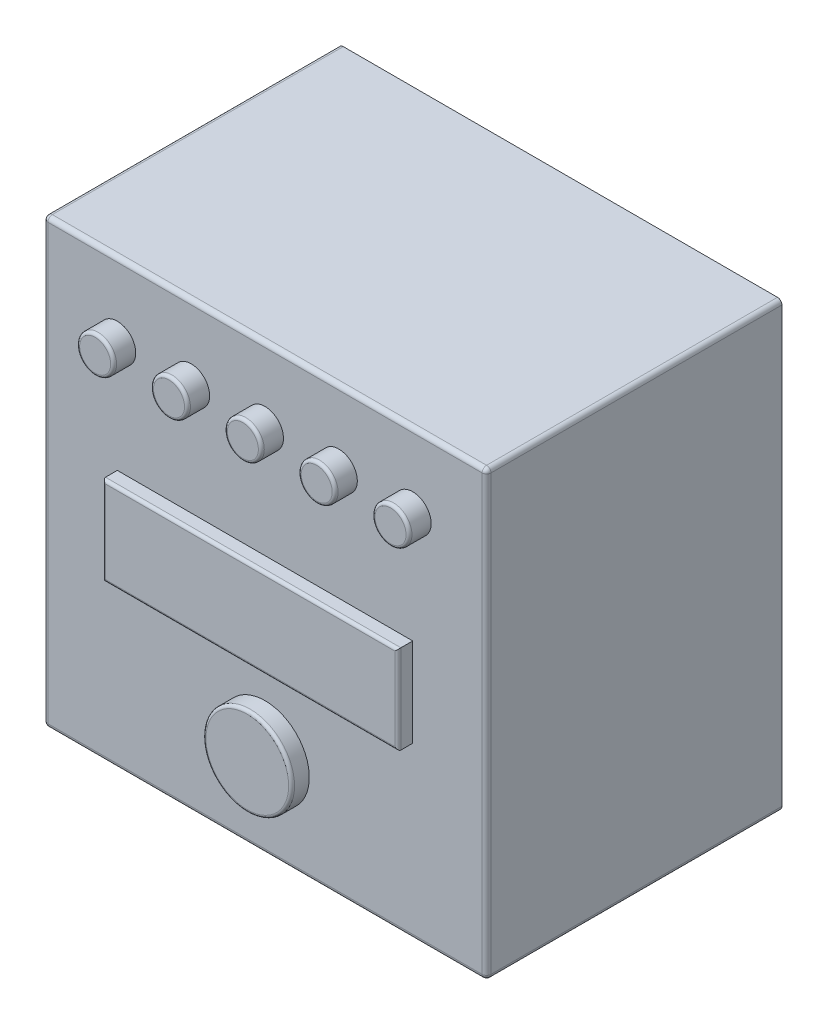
from build123d import *

# Parameters (mm, degrees)
ESQUISSE1_W      = 300
ESQUISSE1_H      = 300
EXTRUSION1_DEPTH = 200
COQUE1_T         = 5
ESQUISSE2_R      = 12.5
EXTRUSION2_DEPTH = 15
CONG_1_R         = 2
ESQUISSE3_W      = 200
ESQUISSE3_H      = 60
EXTRUSION3_DEPTH = 10
CONG_2_R         = 2
ESQUISSE4_R      = 30
EXTRUSION4_DEPTH = 12
CONG_4_R         = 3
CONG_5_R         = 2


with BuildPart() as part:
    # Esquisse1 → Extrusion1 (new body)
    with BuildSketch(Plane.XY):
        with Locations((150, 150)):
            Rectangle(ESQUISSE1_W, ESQUISSE1_H)
    extrude(amount=EXTRUSION1_DEPTH)

    # Coque1 (no face opened: a closed hollow body)
    add(offset(amount=-COQUE1_T, mode=Mode.PRIVATE), mode=Mode.SUBTRACT)

    # Esquisse2 → Extrusion2 (add)
    with BuildSketch(Plane.XY.offset(200)):
        with Locations(Location((50, 250, 0), (0, 0, 180))):
            Circle(ESQUISSE2_R)
        with Locations(Location((100, 250, 0), (0, 0, 180))):
            Circle(ESQUISSE2_R)
        with Locations(Location((200, 250, 0), (0, 0, 180))):
            Circle(ESQUISSE2_R)
        with Locations(Location((150, 250, 0), (0, 0, 180))):
            Circle(ESQUISSE2_R)
        with Locations(Location((250, 250, 0), (0, 0, 180))):
            Circle(ESQUISSE2_R)
    extrude(amount=EXTRUSION2_DEPTH)

    # Cong_1
    cong_1_edges = [part.edges().sort_by_distance(p)[0] for p in [
        (62.5, 250, 215),
        (112.5, 250, 215),
        (162.5, 250, 215),
        (212.5, 250, 215),
        (262.5, 250, 215),
    ]]
    fillet(cong_1_edges, radius=CONG_1_R)

    # Esquisse3 → Extrusion3 (add)
    with BuildSketch(Plane.XY.offset(200)):
        with Locations((150, 145)):
            Rectangle(ESQUISSE3_W, ESQUISSE3_H)
    extrude(amount=EXTRUSION3_DEPTH)

    # Cong_2
    cong_2_edges = [part.edges().sort_by_distance(p)[0] for p in [
        (50, 145, 210),
        (150, 115, 210),
        (250, 145, 210),
        (150, 175, 210),
    ]]
    fillet(cong_2_edges, radius=CONG_2_R)

    # Esquisse4 → Extrusion4 (add)
    with BuildSketch(Plane.XY.offset(200)):
        with Locations(Location((150, 60, 0), (0, 0, 180))):
            Circle(ESQUISSE4_R)
    extrude(amount=EXTRUSION4_DEPTH)

    # Cong_4
    cong_4_edges = [part.edges().sort_by_distance(p)[0] for p in [
        (300, 150, 200),
        (150, 300, 200),
        (0, 150, 200),
        (150, 0, 200),
        (0, 300, 100),
        (300, 300, 100),
        (300, 0, 100),
        (0, 0, 100),
    ]]
    fillet(cong_4_edges, radius=CONG_4_R)

    # Cong_5
    cong_5_edges = [part.edges().sort_by_distance(p)[0] for p in [
        (180, 60, 212),
    ]]
    fillet(cong_5_edges, radius=CONG_5_R)


solid = part.part
